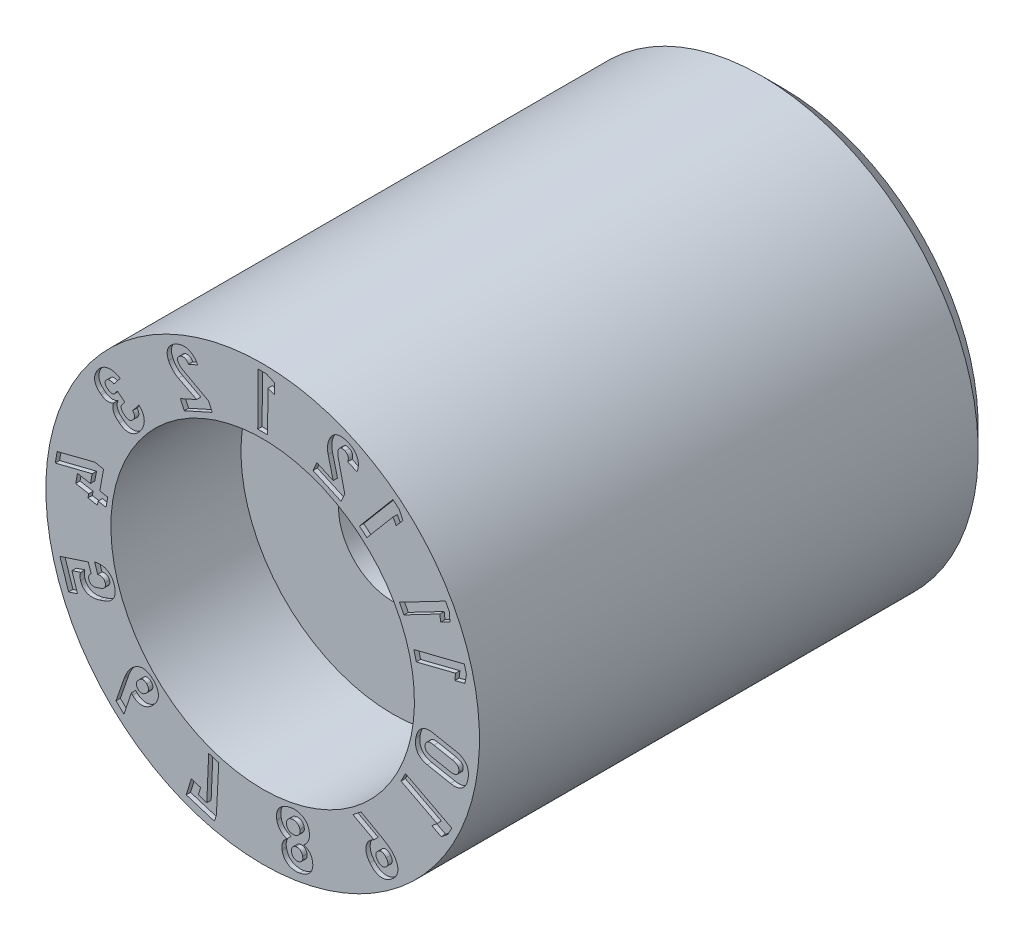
from build123d import *

# Parameters (mm, degrees)
CUT_EXTRUDE1_DEPTH = 0.1


with BuildPart() as part:
    # Sketch1 → Revolve1 (revolve)
    with BuildSketch(Plane(origin=(0, 0, 0), x_dir=(0, 0, -1), z_dir=(1, 0, 0)), mode=Mode.PRIVATE) as revolve1_sk:
        Polygon((12, 1.25), (12, 4.5), (11.5, 5), (0, 5), (0, 3.5), (3, 3.5), (3, 1.25), align=None)
    revolve(revolve1_sk.sketch.rotate(Axis((0, 0, 0), (0, 0, -1)), 180), axis=Axis((0, 0, 0), (0, 0, -1)))

    # Sketch2 → Cut-Extrude1 (cut)
    # profile 1 of 15: a face of its own
    with BuildSketch(Plane.XY):
        Polygon((-0.1134802, 3.635209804), (0.113138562, 3.633054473), (0.122147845, 4.570193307), (0.26814769, 4.513103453), (0.270554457, 4.754200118), (0.091451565, 4.837004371), (-0.102047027, 4.838691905), align=None)
    # profile 2 of 15: a face of its own
    with BuildSketch(Plane.XY):
        with BuildLine():
            Line((-1.246425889, 3.629500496), (-1.841836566, 3.95313337))
            add(Edge.make_bspline(
                [(-1.841836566, 3.95313337), (-1.867024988, 3.966640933), (-1.896766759, 3.986751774), (-1.925260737, 4.017127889), (-1.940885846, 4.035975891), (-1.949849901, 4.051525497), (-1.954700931, 4.061965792)],
                knots=[0, 0, 0, 0, 0.539912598, 0.66450377, 0.78319409, 1, 1, 1, 1], degree=3))
            Line((-1.954700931, 4.061965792), (-1.955388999, 4.063088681))
            add(Edge.make_bspline(
                [(-1.955388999, 4.063088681), (-1.961131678, 4.076487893), (-1.967575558, 4.09753426), (-1.964885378, 4.125686), (-1.95823551, 4.144970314), (-1.946880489, 4.162857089), (-1.924883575, 4.185700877), (-1.902981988, 4.197796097), (-1.887482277, 4.204933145)],
                knots=[0, 0, 0, 0, 0.247436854, 0.358127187, 0.470367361, 0.587238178, 0.71148399, 1, 1, 1, 1], degree=3))
            add(Edge.make_bspline(
                [(-1.887482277, 4.204933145), (-1.87182515, 4.212301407), (-1.84675559, 4.218740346), (-1.812976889, 4.216513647), (-1.7892417, 4.208902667), (-1.76629923, 4.196977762), (-1.737109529, 4.172367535), (-1.719317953, 4.148551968), (-1.709083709, 4.130825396)],
                knots=[0, 0, 0, 0, 0.241879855, 0.354192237, 0.469267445, 0.588145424, 0.713727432, 1, 1, 1, 1], degree=3))
            Line((-1.709083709, 4.130825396), (-1.49787548, 4.224722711))
            add(Edge.make_bspline(
                [(-1.49787548, 4.224722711), (-1.515029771, 4.25636283), (-1.542527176, 4.300472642), (-1.589034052, 4.349196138), (-1.625277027, 4.379582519), (-1.664082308, 4.403912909), (-1.704758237, 4.422405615), (-1.747310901, 4.434557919), (-1.791372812, 4.440744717), (-1.836602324, 4.440778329), (-1.899191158, 4.432178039), (-1.94500455, 4.416735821), (-1.974787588, 4.403297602)],
                knots=[0, 0, 0, 0, 0.185833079, 0.271834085, 0.354543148, 0.434818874, 0.512789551, 0.58957393, 0.667544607, 0.746872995, 0.827489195, 1, 1, 1, 1], degree=3))
            add(Edge.make_bspline(
                [(-1.974787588, 4.403297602), (-2.006416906, 4.389146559), (-2.050899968, 4.364887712), (-2.102423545, 4.32456869), (-2.134166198, 4.292814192), (-2.160354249, 4.258934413), (-2.180194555, 4.222734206), (-2.194226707, 4.184711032), (-2.201624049, 4.144786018), (-2.203219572, 4.103525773), (-2.196444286, 4.045236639), (-2.181792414, 4.002449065), (-2.169449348, 3.974367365)],
                knots=[0, 0, 0, 0, 0.194478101, 0.28254806, 0.36616185, 0.445730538, 0.521908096, 0.596845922, 0.672103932, 0.748712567, 0.827648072, 1, 1, 1, 1], degree=3))
            add(Edge.make_bspline(
                [(-2.169449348, 3.974367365), (-2.157698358, 3.9489313), (-2.138102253, 3.912740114), (-2.104894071, 3.868872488), (-2.077408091, 3.837288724), (-2.047251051, 3.808188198), (-2.004416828, 3.773078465), (-1.969714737, 3.750457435), (-1.945181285, 3.737965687)],
                knots=[0, 0, 0, 0, 0.24635447, 0.371238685, 0.498231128, 0.625663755, 0.750716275, 1, 1, 1, 1], degree=3))
            Line((-1.945181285, 3.737965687), (-1.524545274, 3.519900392))
            Line((-1.524545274, 3.519900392), (-1.897329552, 3.352452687))
            Line((-1.897329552, 3.352452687), (-1.808313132, 3.154337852))
            Line((-1.808313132, 3.154337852), (-1.163120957, 3.444183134))
            Line((-1.163120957, 3.444183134), (-1.246425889, 3.629500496))
        make_face()
    # profile 3 of 15: a face of its own
    with BuildSketch(Plane.XY):
        with BuildLine():
            Line((-2.853920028, 2.74460677), (-2.997997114, 2.561596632))
            add(Edge.make_bspline(
                [(-2.997997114, 2.561596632), (-2.989819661, 2.553175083), (-2.978784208, 2.539781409), (-2.967660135, 2.520217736), (-2.961348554, 2.505698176), (-2.957563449, 2.490933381), (-2.955496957, 2.476224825), (-2.955169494, 2.461530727), (-2.95706704, 2.446844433), (-2.961026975, 2.432364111), (-2.969201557, 2.412985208), (-2.977838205, 2.399418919), (-2.984479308, 2.390778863)],
                knots=[0, 0, 0, 0, 0.186025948, 0.272841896, 0.355691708, 0.435874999, 0.513332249, 0.590477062, 0.667826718, 0.746932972, 0.827427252, 1, 1, 1, 1], degree=3))
            add(Edge.make_bspline(
                [(-2.984479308, 2.390778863), (-2.996541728, 2.37588816), (-3.016560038, 2.355565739), (-3.049373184, 2.339725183), (-3.074103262, 2.334075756), (-3.099560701, 2.334127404), (-3.135068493, 2.343324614), (-3.159674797, 2.35766957), (-3.174779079, 2.369975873)],
                knots=[0, 0, 0, 0, 0.266119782, 0.383958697, 0.498069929, 0.613267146, 0.731491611, 1, 1, 1, 1], degree=3))
            Line((-3.174779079, 2.369975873), (-3.196755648, 2.387125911))
            add(Edge.make_bspline(
                [(-3.196755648, 2.387125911), (-3.213031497, 2.399448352), (-3.234001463, 2.419907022), (-3.254359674, 2.451107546), (-3.262737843, 2.47397875), (-3.266226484, 2.496759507), (-3.262446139, 2.527689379), (-3.251101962, 2.548789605), (-3.240977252, 2.561089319)],
                knots=[0, 0, 0, 0, 0.300693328, 0.428097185, 0.545951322, 0.657228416, 0.764774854, 1, 1, 1, 1], degree=3))
            Line((-3.240977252, 2.561089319), (-3.178402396, 2.640793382))
            Line((-3.178402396, 2.640793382), (-3.349186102, 2.775291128))
            Line((-3.349186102, 2.775291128), (-3.411760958, 2.695587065))
            add(Edge.make_bspline(
                [(-3.411760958, 2.695587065), (-3.419734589, 2.6854322), (-3.434635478, 2.672179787), (-3.459286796, 2.664572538), (-3.478742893, 2.66305857), (-3.499268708, 2.666341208), (-3.529260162, 2.676838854), (-3.550316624, 2.690543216), (-3.563802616, 2.701495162)],
                knots=[0, 0, 0, 0, 0.227690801, 0.334652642, 0.446366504, 0.566263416, 0.695466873, 1, 1, 1, 1], degree=3))
            Line((-3.563802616, 2.701495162), (-3.580207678, 2.714319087))
            add(Edge.make_bspline(
                [(-3.580207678, 2.714319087), (-3.593025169, 2.724486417), (-3.610591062, 2.740896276), (-3.625531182, 2.767486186), (-3.631557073, 2.786996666), (-3.633330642, 2.806709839), (-3.628679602, 2.833652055), (-3.6182975, 2.852023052), (-3.609560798, 2.863084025)],
                knots=[0, 0, 0, 0, 0.286987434, 0.411384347, 0.528029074, 0.640813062, 0.753408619, 1, 1, 1, 1], degree=3))
            add(Edge.make_bspline(
                [(-3.609560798, 2.863084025), (-3.603426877, 2.870660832), (-3.593087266, 2.881370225), (-3.576213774, 2.891238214), (-3.562949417, 2.897329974), (-3.548731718, 2.901593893), (-3.533594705, 2.90366872), (-3.517643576, 2.90404514), (-3.500927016, 2.902619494), (-3.483640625, 2.899426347), (-3.459343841, 2.892018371), (-3.44163109, 2.883739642), (-3.429773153, 2.877537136)],
                knots=[0, 0, 0, 0, 0.14918583, 0.222996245, 0.296639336, 0.371187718, 0.448158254, 0.5286829, 0.613797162, 0.703291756, 0.795969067, 1, 1, 1, 1], degree=3))
            Line((-3.429773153, 2.877537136), (-3.286082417, 3.060160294))
            add(Edge.make_bspline(
                [(-3.286082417, 3.060160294), (-3.31508121, 3.07924092), (-3.360473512, 3.102755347), (-3.423961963, 3.123110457), (-3.470442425, 3.131205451), (-3.51620188, 3.133918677), (-3.56094595, 3.130517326), (-3.604172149, 3.120917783), (-3.645817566, 3.105698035), (-3.685277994, 3.085012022), (-3.735217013, 3.049884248), (-3.76757485, 3.016626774), (-3.786758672, 2.992085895)],
                knots=[0, 0, 0, 0, 0.185755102, 0.272003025, 0.355978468, 0.437668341, 0.516842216, 0.595400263, 0.673986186, 0.753554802, 0.833228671, 1, 1, 1, 1], degree=3))
            add(Edge.make_bspline(
                [(-3.786758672, 2.992085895), (-3.80207439, 2.97231026), (-3.823387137, 2.942416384), (-3.845525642, 2.900201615), (-3.858359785, 2.869660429), (-3.867743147, 2.839242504), (-3.873725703, 2.808995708), (-3.876434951, 2.778906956), (-3.875449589, 2.74908421), (-3.871513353, 2.719815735), (-3.863642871, 2.691353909), (-3.85290268, 2.663640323), (-3.838642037, 2.636648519), (-3.820850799, 2.610635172), (-3.791710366, 2.576369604), (-3.766508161, 2.55276047), (-3.747799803, 2.538404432)],
                knots=[0, 0, 0, 0, 0.144969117, 0.211725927, 0.275613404, 0.336511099, 0.395693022, 0.453821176, 0.511004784, 0.568118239, 0.62437708, 0.681552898, 0.739899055, 0.800707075, 0.863632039, 1, 1, 1, 1], degree=3))
            Line((-3.747799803, 2.538404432), (-3.719477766, 2.516155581))
            add(Edge.make_bspline(
                [(-3.719477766, 2.516155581), (-3.699071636, 2.499723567), (-3.665509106, 2.479698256), (-3.616803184, 2.464016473), (-3.579945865, 2.458386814), (-3.542660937, 2.459042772), (-3.492117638, 2.467297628), (-3.456199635, 2.4831067), (-3.433561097, 2.496204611)],
                knots=[0, 0, 0, 0, 0.256817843, 0.378651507, 0.499846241, 0.620687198, 0.742908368, 1, 1, 1, 1], degree=3))
            add(Edge.make_bspline(
                [(-3.433561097, 2.496204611), (-3.439492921, 2.483265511), (-3.447482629, 2.463468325), (-3.452986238, 2.436097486), (-3.45595512, 2.41593365), (-3.455924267, 2.39571943), (-3.454382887, 2.375472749), (-3.451077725, 2.355103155), (-3.445150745, 2.334959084), (-3.437740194, 2.314839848), (-3.428305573, 2.295117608), (-3.416884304, 2.275958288), (-3.403884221, 2.257044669), (-3.388612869, 2.238822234), (-3.365698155, 2.214200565), (-3.346457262, 2.197101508), (-3.332621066, 2.18649052)],
                knots=[0, 0, 0, 0, 0.120732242, 0.179156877, 0.235905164, 0.292824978, 0.349690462, 0.407624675, 0.466993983, 0.52702443, 0.588865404, 0.651622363, 0.715561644, 0.7827963, 0.852537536, 1, 1, 1, 1], degree=3))
            Line((-3.332621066, 2.18649052), (-3.304299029, 2.164241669))
            add(Edge.make_bspline(
                [(-3.304299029, 2.164241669), (-3.278729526, 2.144083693), (-3.238627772, 2.117841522), (-3.180957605, 2.095129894), (-3.139008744, 2.084864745), (-3.097106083, 2.081392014), (-3.055637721, 2.084245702), (-3.01472181, 2.093835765), (-2.974604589, 2.109977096), (-2.93559574, 2.132482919), (-2.883652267, 2.171989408), (-2.849116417, 2.208778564), (-2.827753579, 2.235853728)],
                knots=[0, 0, 0, 0, 0.178576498, 0.260028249, 0.338439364, 0.414233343, 0.489377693, 0.565161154, 0.643413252, 0.725361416, 0.811053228, 1, 1, 1, 1], degree=3))
            add(Edge.make_bspline(
                [(-2.827753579, 2.235853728), (-2.806701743, 2.26310863), (-2.778480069, 2.305623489), (-2.751929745, 2.366627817), (-2.738242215, 2.411830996), (-2.730267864, 2.457121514), (-2.729525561, 2.502093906), (-2.733859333, 2.546567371), (-2.745225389, 2.590053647), (-2.762693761, 2.632300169), (-2.795282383, 2.687287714), (-2.82893074, 2.723028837), (-2.853920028, 2.74460677)],
                knots=[0, 0, 0, 0, 0.181595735, 0.267031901, 0.349589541, 0.429881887, 0.508385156, 0.585787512, 0.664560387, 0.744189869, 0.825878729, 1, 1, 1, 1], degree=3))
        make_face()
    # profile 4 of 15: a face of its own
    with BuildSketch(Plane.XY):
        Polygon((-3.873884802, 1.096013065), (-4.737677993, 0.875332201), (-4.783602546, 0.622327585), (-3.931349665, 0.835309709), (-3.970616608, 0.619088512), (-4.270709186, 0.673523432), (-4.311211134, 0.449979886), (-4.011210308, 0.395561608), (-4.028068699, 0.302731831), (-3.812796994, 0.263520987), (-3.795921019, 0.356509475), (-3.613069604, 0.323341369), (-3.572567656, 0.546884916), (-3.755353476, 0.580041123), (-3.668468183, 1.058788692), align=None)
    # profile 5 of 15: a face of its own
    with BuildSketch(Plane.XY):
        with BuildLine():
            Line((-3.874503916, -0.897675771), (-3.805070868, -1.112473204))
            add(Edge.make_bspline(
                [(-3.805070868, -1.112473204), (-3.784801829, -1.107611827), (-3.755752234, -1.104845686), (-3.718573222, -1.109416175), (-3.694503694, -1.117655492), (-3.673215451, -1.129902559), (-3.649245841, -1.152735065), (-3.637482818, -1.175141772), (-3.632319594, -1.191100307)],
                knots=[0, 0, 0, 0, 0.286271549, 0.412475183, 0.531825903, 0.646991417, 0.760338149, 1, 1, 1, 1], degree=3))
            add(Edge.make_bspline(
                [(-3.632319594, -1.191100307), (-3.626730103, -1.208025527), (-3.622277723, -1.234385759), (-3.62900585, -1.268260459), (-3.63983416, -1.290823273), (-3.655718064, -1.311507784), (-3.686135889, -1.336088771), (-3.71404315, -1.348751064), (-3.734136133, -1.355264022)],
                knots=[0, 0, 0, 0, 0.245289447, 0.356071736, 0.468102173, 0.585274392, 0.710393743, 1, 1, 1, 1], degree=3))
            Line((-3.734136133, -1.355264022), (-3.829707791, -1.386578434))
            add(Edge.make_bspline(
                [(-3.829707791, -1.386578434), (-3.849754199, -1.392360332), (-3.879270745, -1.400730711), (-3.917681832, -1.398847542), (-3.942248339, -1.393613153), (-3.963551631, -1.383280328), (-3.988165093, -1.363450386), (-3.999649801, -1.34191896), (-4.004525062, -1.326706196)],
                knots=[0, 0, 0, 0, 0.302991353, 0.431512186, 0.549947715, 0.661867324, 0.768838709, 1, 1, 1, 1], degree=3))
            add(Edge.make_bspline(
                [(-4.004525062, -1.326706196), (-4.009274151, -1.312294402), (-4.013547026, -1.290148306), (-4.01204225, -1.260753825), (-4.007187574, -1.240227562), (-3.999224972, -1.220935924), (-3.983636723, -1.197020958), (-3.967694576, -1.182154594), (-3.955590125, -1.173888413)],
                knots=[0, 0, 0, 0, 0.263177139, 0.386092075, 0.507659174, 0.627113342, 0.746106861, 1, 1, 1, 1], degree=3))
            Line((-3.955590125, -1.173888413), (-4.021279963, -0.973712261))
            Line((-4.021279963, -0.973712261), (-4.675226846, -1.187811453))
            Line((-4.675226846, -1.187811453), (-4.475001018, -1.798591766))
            Line((-4.475001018, -1.798591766), (-4.268641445, -1.731044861))
            Line((-4.268641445, -1.731044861), (-4.398538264, -1.334599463))
            Line((-4.398538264, -1.334599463), (-4.19730462, -1.268630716))
            add(Edge.make_bspline(
                [(-4.19730462, -1.268630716), (-4.202968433, -1.279879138), (-4.208373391, -1.29857202), (-4.212471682, -1.325095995), (-4.213084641, -1.347090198), (-4.212469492, -1.369678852), (-4.20890321, -1.399313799), (-4.204177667, -1.420978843), (-4.199272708, -1.434849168)],
                knots=[0, 0, 0, 0, 0.221290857, 0.341875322, 0.473265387, 0.609338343, 0.74075997, 1, 1, 1, 1], degree=3))
            add(Edge.make_bspline(
                [(-4.199272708, -1.434849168), (-4.190094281, -1.462306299), (-4.172683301, -1.501589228), (-4.138755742, -1.546053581), (-4.109622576, -1.573330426), (-4.077158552, -1.596101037), (-4.040629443, -1.612686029), (-4.001018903, -1.624663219), (-3.957891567, -1.630242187), (-3.911912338, -1.631378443), (-3.844603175, -1.624612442), (-3.793664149, -1.612231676), (-3.759540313, -1.600729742)],
                knots=[0, 0, 0, 0, 0.163393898, 0.23933488, 0.313590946, 0.387435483, 0.461667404, 0.538627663, 0.619718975, 0.705844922, 0.797241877, 1, 1, 1, 1], degree=3))
            Line((-3.759540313, -1.600729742), (-3.663968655, -1.56941533))
            add(Edge.make_bspline(
                [(-3.663968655, -1.56941533), (-3.62971555, -1.558185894), (-3.58106074, -1.537524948), (-3.523744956, -1.500241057), (-3.488106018, -1.469149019), (-3.458002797, -1.435193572), (-3.434305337, -1.397713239), (-3.416720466, -1.357357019), (-3.405436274, -1.314063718), (-3.400583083, -1.268399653), (-3.402407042, -1.202352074), (-3.414727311, -1.152732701), (-3.425188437, -1.119617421)],
                knots=[0, 0, 0, 0, 0.186919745, 0.272247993, 0.353373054, 0.431356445, 0.506632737, 0.582239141, 0.658645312, 0.737601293, 0.819506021, 1, 1, 1, 1], degree=3))
            add(Edge.make_bspline(
                [(-3.425188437, -1.119617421), (-3.434399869, -1.09020649), (-3.453975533, -1.048780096), (-3.488500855, -0.999371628), (-3.51871319, -0.967414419), (-3.552630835, -0.939909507), (-3.590237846, -0.917439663), (-3.631235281, -0.89995026), (-3.675491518, -0.888056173), (-3.722408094, -0.881608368), (-3.789586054, -0.880899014), (-3.840583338, -0.888925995), (-3.874503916, -0.897675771)],
                knots=[0, 0, 0, 0, 0.165309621, 0.244619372, 0.323096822, 0.400896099, 0.478636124, 0.557815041, 0.639725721, 0.724228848, 0.811710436, 1, 1, 1, 1], degree=3))
        make_face()
    # profile 6 of 15: a face of its own
    with BuildSketch(Plane.XY):
        with BuildLine():
            Line((-3.195774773, -2.887855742), (-3.381343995, -3.424873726))
            Line((-3.381343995, -3.424873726), (-3.199200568, -3.602670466))
            Line((-3.199200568, -3.602670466), (-3.026755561, -3.088592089))
            add(Edge.make_bspline(
                [(-3.026755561, -3.088592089), (-3.018507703, -3.100694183), (-3.008713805, -3.111760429), (-2.998337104, -3.122033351)],
                knots=[0.757709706, 0.757709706, 0.757709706, 0.757709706, 1, 1, 1, 1], degree=3))
            add(Edge.make_bspline(
                [(-2.998337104, -3.122033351), (-2.976510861, -3.143552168), (-2.941097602, -3.171681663), (-2.888590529, -3.197779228), (-2.84921371, -3.210405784), (-2.809097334, -3.21664989), (-2.768422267, -3.216738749), (-2.727516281, -3.210082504), (-2.686501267, -3.197246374), (-2.645526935, -3.178383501), (-2.589853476, -3.143094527), (-2.551060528, -3.109901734), (-2.526901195, -3.084530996)],
                knots=[0, 0, 0, 0, 0.171440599, 0.250313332, 0.326601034, 0.401649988, 0.47637042, 0.55300431, 0.632355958, 0.715925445, 0.804372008, 1, 1, 1, 1], degree=3))
            add(Edge.make_bspline(
                [(-2.526901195, -3.084530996), (-2.501862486, -3.058146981), (-2.467698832, -3.018282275), (-2.434925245, -2.958883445), (-2.417353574, -2.915377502), (-2.406344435, -2.871480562), (-2.402440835, -2.827631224), (-2.405487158, -2.783956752), (-2.415525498, -2.740855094), (-2.432256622, -2.698425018), (-2.464194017, -2.641368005), (-2.497137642, -2.60296306), (-2.521663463, -2.578879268)],
                knots=[0, 0, 0, 0, 0.186963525, 0.271936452, 0.353495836, 0.431521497, 0.507541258, 0.582570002, 0.659340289, 0.737870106, 0.820147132, 1, 1, 1, 1], degree=3))
            add(Edge.make_bspline(
                [(-2.521663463, -2.578879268), (-2.545992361, -2.5546786), (-2.585390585, -2.52331699), (-2.642682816, -2.49217508), (-2.685339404, -2.476435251), (-2.728452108, -2.467477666), (-2.771850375, -2.465218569), (-2.815232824, -2.469822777), (-2.858543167, -2.481056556), (-2.901184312, -2.499382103), (-2.959369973, -2.533048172), (-2.998265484, -2.567740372), (-3.023234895, -2.592874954)],
                knots=[0, 0, 0, 0, 0.18040979, 0.263072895, 0.342081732, 0.418699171, 0.493848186, 0.56974829, 0.647310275, 0.728304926, 0.813162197, 1, 1, 1, 1], degree=3))
            add(Edge.make_bspline(
                [(-3.023234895, -2.592874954), (-3.039113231, -2.60924353), (-3.061386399, -2.634984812), (-3.088592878, -2.672281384), (-3.129626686, -2.734784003), (-3.157360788, -2.791744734), (-3.177077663, -2.838566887)],
                knots=[0, 0, 0, 0, 0.229583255, 0.350319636, 0.475661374, 1, 1, 1, 1], degree=3))
            add(Edge.make_bspline(
                [(-3.177077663, -2.838566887), (-3.180307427, -2.846775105), (-3.187860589, -2.862713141), (-3.192592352, -2.879702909), (-3.195774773, -2.887855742)],
                knots=[0, 0, 0, 0, 0.502193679, 1, 1, 1, 1], degree=3))
        make_face()
        with BuildLine():
            add(Edge.make_bspline(
                [(-2.673148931, -2.734023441), (-2.660515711, -2.746646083), (-2.643897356, -2.767321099), (-2.632751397, -2.799500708), (-2.630728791, -2.823388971), (-2.63414867, -2.847534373), (-2.646713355, -2.881135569), (-2.664606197, -2.902937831), (-2.677676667, -2.916820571)],
                knots=[0, 0, 0, 0, 0.259214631, 0.373657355, 0.486603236, 0.601859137, 0.722848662, 1, 1, 1, 1], degree=3))
            add(Edge.make_bspline(
                [(-2.677676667, -2.916820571), (-2.693400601, -2.933170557), (-2.717767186, -2.953636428), (-2.754347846, -2.970860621), (-2.780308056, -2.97672978), (-2.805779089, -2.977003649), (-2.839612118, -2.968283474), (-2.86163096, -2.952605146), (-2.874417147, -2.939902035)],
                knots=[0, 0, 0, 0, 0.294939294, 0.420169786, 0.537632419, 0.648469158, 0.757895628, 1, 1, 1, 1], degree=3))
            add(Edge.make_bspline(
                [(-2.874417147, -2.939902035), (-2.887550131, -2.927669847), (-2.902952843, -2.905731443), (-2.912563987, -2.872108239), (-2.91258254, -2.846296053), (-2.906899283, -2.820071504), (-2.890617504, -2.783178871), (-2.870387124, -2.758771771), (-2.855450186, -2.742972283)],
                knots=[0, 0, 0, 0, 0.2398179, 0.35038577, 0.463369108, 0.581792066, 0.707462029, 1, 1, 1, 1], degree=3))
            add(Edge.make_bspline(
                [(-2.855450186, -2.742972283), (-2.841629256, -2.728556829), (-2.819836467, -2.711141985), (-2.786893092, -2.697690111), (-2.763025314, -2.693787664), (-2.739155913, -2.695289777), (-2.707128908, -2.7062482), (-2.685550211, -2.721108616), (-2.673148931, -2.734023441)],
                knots=[0, 0, 0, 0, 0.277582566, 0.397866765, 0.512799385, 0.62583409, 0.741295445, 1, 1, 1, 1], degree=3))
        make_face(mode=Mode.SUBTRACT)
    # profile 7 of 15: a face of its own
    with BuildSketch(Plane.XY):
        Polygon((-1.067288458, -4.553962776), (-1.012207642, -3.476805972), (-1.245038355, -3.4044337), (-1.288030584, -4.414768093), (-1.484221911, -4.353649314), (-1.430534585, -4.181924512), (-1.645364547, -4.114997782), (-1.763480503, -4.493690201), (-1.111766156, -4.696606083), align=None)
    # profile 8 of 15: a face of its own
    with BuildSketch(Plane.XY):
        with BuildLine():
            Line((0.325150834, -3.939334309), (0.328730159, -3.958761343))
            add(Edge.make_bspline(
                [(0.328730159, -3.958761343), (0.333502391, -3.987983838), (0.348304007, -4.030166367), (0.378157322, -4.081878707), (0.406604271, -4.117311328), (0.439396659, -4.148865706), (0.487974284, -4.184437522), (0.52936808, -4.202772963), (0.558161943, -4.210750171)],
                knots=[0, 0, 0, 0, 0.246741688, 0.370594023, 0.497967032, 0.625509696, 0.750304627, 1, 1, 1, 1], degree=3))
            add(Edge.make_bspline(
                [(0.558161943, -4.210750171), (0.537485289, -4.225716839), (0.509541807, -4.252146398), (0.480053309, -4.293809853), (0.46299868, -4.32774057), (0.45005605, -4.362899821), (0.44060531, -4.41058026), (0.441364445, -4.446881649), (0.44573792, -4.470322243)],
                knots=[0, 0, 0, 0, 0.256852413, 0.384064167, 0.512331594, 0.638329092, 0.760349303, 1, 1, 1, 1], degree=3))
            Line((0.44573792, -4.470322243), (0.451292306, -4.501271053))
            add(Edge.make_bspline(
                [(0.451292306, -4.501271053), (0.456418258, -4.530543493), (0.469496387, -4.572744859), (0.497526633, -4.623383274), (0.523205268, -4.656609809), (0.553323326, -4.685476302), (0.587361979, -4.70976077), (0.625158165, -4.729153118), (0.666462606, -4.743679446), (0.71073161, -4.75308994), (0.774740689, -4.75827516), (0.823802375, -4.753805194), (0.856713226, -4.747866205)],
                knots=[0, 0, 0, 0, 0.166941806, 0.245901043, 0.324166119, 0.402022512, 0.47953714, 0.558336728, 0.639971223, 0.724914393, 0.811973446, 1, 1, 1, 1], degree=3))
            add(Edge.make_bspline(
                [(0.856713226, -4.747866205), (0.889660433, -4.74204473), (0.937194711, -4.728878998), (0.995400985, -4.701785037), (1.033648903, -4.677567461), (1.067323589, -4.649708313), (1.095967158, -4.61828683), (1.119283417, -4.583651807), (1.137496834, -4.546099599), (1.149667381, -4.505938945), (1.159098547, -4.44880368), (1.15540119, -4.404633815), (1.150499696, -4.375475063)],
                knots=[0, 0, 0, 0, 0.188044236, 0.275560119, 0.360013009, 0.441803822, 0.520508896, 0.59814778, 0.675716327, 0.754188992, 0.833242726, 1, 1, 1, 1], degree=3))
            Line((1.150499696, -4.375475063), (1.14494531, -4.344526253))
            add(Edge.make_bspline(
                [(1.14494531, -4.344526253), (1.141068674, -4.320535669), (1.128637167, -4.285946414), (1.102714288, -4.244190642), (1.077819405, -4.216030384), (1.049602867, -4.19045602), (1.007165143, -4.16190057), (0.97133026, -4.147519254), (0.946672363, -4.140803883)],
                knots=[0, 0, 0, 0, 0.24228418, 0.363838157, 0.489932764, 0.617220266, 0.744143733, 1, 1, 1, 1], degree=3))
            add(Edge.make_bspline(
                [(0.946672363, -4.140803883), (0.971076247, -4.122818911), (1.003769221, -4.090938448), (1.03784115, -4.040641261), (1.05761726, -3.999537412), (1.07233672, -3.956509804), (1.083352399, -3.897871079), (1.081548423, -3.85316837), (1.076337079, -3.824232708)],
                knots=[0, 0, 0, 0, 0.252403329, 0.376970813, 0.504622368, 0.631472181, 0.755006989, 1, 1, 1, 1], degree=3))
            Line((1.076337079, -3.824232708), (1.072757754, -3.804805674))
            add(Edge.make_bspline(
                [(1.072757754, -3.804805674), (1.067380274, -3.773731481), (1.053719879, -3.728893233), (1.023872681, -3.675232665), (0.996473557, -3.640209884), (0.964472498, -3.609634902), (0.928181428, -3.584121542), (0.887933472, -3.563488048), (0.843684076, -3.548748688), (0.796396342, -3.538708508), (0.727825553, -3.533083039), (0.675222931, -3.53830787), (0.639916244, -3.544469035)],
                knots=[0, 0, 0, 0, 0.16638843, 0.24484758, 0.322812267, 0.400145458, 0.477565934, 0.556117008, 0.637943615, 0.722946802, 0.810666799, 1, 1, 1, 1], degree=3))
            add(Edge.make_bspline(
                [(0.639916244, -3.544469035), (0.604734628, -3.550840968), (0.553742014, -3.564668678), (0.491492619, -3.593813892), (0.45044313, -3.619579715), (0.414455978, -3.649132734), (0.383505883, -3.682127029), (0.358635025, -3.718830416), (0.339390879, -3.758603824), (0.325968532, -3.800924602), (0.316871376, -3.861574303), (0.319496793, -3.908336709), (0.325150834, -3.939334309)],
                knots=[0, 0, 0, 0, 0.188910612, 0.277155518, 0.362104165, 0.4441637, 0.522419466, 0.600160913, 0.677336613, 0.755001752, 0.833682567, 1, 1, 1, 1], degree=3))
        make_face()
        with BuildLine():
            Line((0.856699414, -3.877278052), (0.858674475, -3.888799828))
            add(Edge.make_bspline(
                [(0.858674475, -3.888799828), (0.860864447, -3.901317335), (0.862258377, -3.920367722), (0.85789469, -3.944893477), (0.85267454, -3.962181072), (0.844725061, -3.978241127), (0.834427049, -3.992949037), (0.82208718, -4.006534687), (0.807448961, -4.018515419), (0.791019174, -4.029248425), (0.76561709, -4.040623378), (0.745124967, -4.046580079), (0.730801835, -4.048984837)],
                knots=[0, 0, 0, 0, 0.165972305, 0.245197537, 0.323319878, 0.400411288, 0.477436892, 0.55648413, 0.638614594, 0.723145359, 0.811259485, 1, 1, 1, 1], degree=3))
            add(Edge.make_bspline(
                [(0.730801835, -4.048984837), (0.716561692, -4.051587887), (0.695273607, -4.053661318), (0.667648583, -4.051169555), (0.648586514, -4.047292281), (0.630789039, -4.041039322), (0.614528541, -4.032465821), (0.599635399, -4.022029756), (0.586307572, -4.009652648), (0.575128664, -3.995213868), (0.562967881, -3.973365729), (0.557007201, -3.955296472), (0.555125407, -3.942593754)],
                knots=[0, 0, 0, 0, 0.188291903, 0.275651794, 0.359527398, 0.440400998, 0.519826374, 0.597589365, 0.676055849, 0.75519832, 0.833743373, 1, 1, 1, 1], degree=3))
            Line((0.555125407, -3.942593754), (0.552834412, -3.930409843))
            add(Edge.make_bspline(
                [(0.552834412, -3.930409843), (0.550496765, -3.916775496), (0.549021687, -3.896265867), (0.552589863, -3.869617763), (0.557942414, -3.851012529), (0.565514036, -3.833482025), (0.575641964, -3.817477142), (0.588054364, -3.803071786), (0.602520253, -3.790239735), (0.618967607, -3.779079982), (0.644014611, -3.766954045), (0.664465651, -3.761053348), (0.67862668, -3.758482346)],
                knots=[0, 0, 0, 0, 0.17338604, 0.255215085, 0.33550126, 0.415116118, 0.493570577, 0.571725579, 0.652497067, 0.735080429, 0.819818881, 1, 1, 1, 1], degree=3))
            add(Edge.make_bspline(
                [(0.67862668, -3.758482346), (0.692782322, -3.755595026), (0.714038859, -3.754367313), (0.741701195, -3.757378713), (0.760901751, -3.762449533), (0.779041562, -3.769528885), (0.795821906, -3.778843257), (0.810715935, -3.790775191), (0.824096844, -3.804487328), (0.835638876, -3.820128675), (0.848408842, -3.843877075), (0.854245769, -3.863631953), (0.856699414, -3.877278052)],
                knots=[0, 0, 0, 0, 0.179905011, 0.26404949, 0.346402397, 0.427052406, 0.506674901, 0.584959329, 0.664451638, 0.745287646, 0.826806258, 1, 1, 1, 1], degree=3))
        make_face(mode=Mode.SUBTRACT)
        with BuildLine():
            Line((0.921116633, -4.375726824), (0.922986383, -4.387027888))
            add(Edge.make_bspline(
                [(0.922986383, -4.387027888), (0.925099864, -4.398782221), (0.926496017, -4.416428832), (0.923765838, -4.439395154), (0.919389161, -4.455270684), (0.913092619, -4.470092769), (0.904776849, -4.483562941), (0.894651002, -4.495889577), (0.882568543, -4.506752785), (0.868647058, -4.515992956), (0.847778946, -4.526888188), (0.830156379, -4.531282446), (0.818223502, -4.533747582)],
                knots=[0, 0, 0, 0, 0.17640619, 0.259203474, 0.340268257, 0.418727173, 0.496173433, 0.57316953, 0.653516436, 0.73504445, 0.819324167, 1, 1, 1, 1], degree=3))
            add(Edge.make_bspline(
                [(0.818223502, -4.533747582), (0.806222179, -4.53609602), (0.788180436, -4.537216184), (0.764733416, -4.534794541), (0.7484065, -4.530912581), (0.733203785, -4.524882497), (0.719513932, -4.516511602), (0.70677309, -4.506816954), (0.695690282, -4.494872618), (0.686330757, -4.481182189), (0.67528357, -4.460859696), (0.670851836, -4.443674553), (0.668383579, -4.432099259)],
                knots=[0, 0, 0, 0, 0.179633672, 0.264185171, 0.346047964, 0.425846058, 0.503691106, 0.581471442, 0.660754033, 0.742193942, 0.82503507, 1, 1, 1, 1], degree=3))
            Line((0.668383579, -4.432099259), (0.666313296, -4.419810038))
            add(Edge.make_bspline(
                [(0.666313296, -4.419810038), (0.663626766, -4.407495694), (0.662765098, -4.389057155), (0.664912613, -4.364947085), (0.669062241, -4.348111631), (0.675447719, -4.332379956), (0.683424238, -4.317730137), (0.693709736, -4.304774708), (0.705543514, -4.293022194), (0.719311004, -4.283034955), (0.74005437, -4.271452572), (0.757767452, -4.266910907), (0.769702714, -4.26453304)],
                knots=[0, 0, 0, 0, 0.179326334, 0.262457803, 0.345261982, 0.426074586, 0.504638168, 0.582803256, 0.661660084, 0.742329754, 0.825191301, 1, 1, 1, 1], degree=3))
            add(Edge.make_bspline(
                [(0.769702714, -4.26453304), (0.781746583, -4.262675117), (0.799876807, -4.260888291), (0.82338441, -4.264254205), (0.839778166, -4.268885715), (0.85496148, -4.275817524), (0.869102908, -4.284461), (0.881853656, -4.295270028), (0.893157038, -4.308145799), (0.902685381, -4.322831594), (0.914209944, -4.344685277), (0.918408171, -4.3632711), (0.921116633, -4.375726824)],
                knots=[0, 0, 0, 0, 0.173570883, 0.25536576, 0.335658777, 0.414438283, 0.491431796, 0.570109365, 0.650651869, 0.733575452, 0.818033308, 1, 1, 1, 1], degree=3))
        make_face(mode=Mode.SUBTRACT)
    # profile 9 of 15: a face of its own
    with BuildSketch(Plane.XY):
        with BuildLine():
            Line((3.021964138, -3.297964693), (3.021355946, -3.297124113))
            add(Edge.make_bspline(
                [(3.021355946, -3.297124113), (3.008361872, -3.28079584), (2.987078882, -3.256776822), (2.954617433, -3.227436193), (2.927596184, -3.205006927), (2.897991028, -3.18304463), (2.854899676, -3.152700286), (2.820461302, -3.13142898), (2.796843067, -3.11721271)],
                knots=[0, 0, 0, 0, 0.216500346, 0.331860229, 0.453504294, 0.580562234, 0.71402831, 1, 1, 1, 1], degree=3))
            add(Edge.make_bspline(
                [(2.796843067, -3.11721271), (2.789992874, -3.112662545), (2.776079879, -3.104178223), (2.761949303, -3.096058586), (2.7547585, -3.092381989)],
                knots=[0, 0, 0, 0, 0.504559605, 1, 1, 1, 1], degree=3))
            Line((2.7547585, -3.092381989), (2.269718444, -2.819660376))
            Line((2.269718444, -2.819660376), (2.081414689, -2.966790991))
            Line((2.081414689, -2.966790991), (2.564517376, -3.227712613))
            add(Edge.make_bspline(
                [(2.564517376, -3.227712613), (2.56340975, -3.228137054), (2.554802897, -3.231512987), (2.530189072, -3.242768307), (2.508866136, -3.25768766), (2.494705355, -3.268374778)],
                knots=[0.563703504, 0.563703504, 0.563703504, 0.563703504, 0.582833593, 0.712799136, 1, 1, 1, 1], degree=3))
            add(Edge.make_bspline(
                [(2.494705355, -3.268374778), (2.472097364, -3.286077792), (2.441517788, -3.316053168), (2.411348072, -3.36336758), (2.394982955, -3.400696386), (2.384327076, -3.439855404), (2.378831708, -3.480320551), (2.380300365, -3.521975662), (2.386796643, -3.564531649), (2.399387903, -3.607343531), (2.424277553, -3.665584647), (2.45087068, -3.706341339), (2.471322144, -3.732233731)],
                knots=[0, 0, 0, 0, 0.165144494, 0.243174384, 0.321091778, 0.398352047, 0.475654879, 0.554734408, 0.636925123, 0.722391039, 0.810350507, 1, 1, 1, 1], degree=3))
            add(Edge.make_bspline(
                [(2.471322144, -3.732233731), (2.494057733, -3.761076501), (2.529698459, -3.800277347), (2.584401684, -3.841352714), (2.625441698, -3.864846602), (2.667674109, -3.881460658), (2.710728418, -3.891131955), (2.754446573, -3.894159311), (2.798704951, -3.890249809), (2.843159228, -3.879170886), (2.904339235, -3.854949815), (2.946828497, -3.826837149), (2.974203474, -3.805714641)],
                knots=[0, 0, 0, 0, 0.187500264, 0.273117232, 0.354450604, 0.432443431, 0.507964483, 0.582802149, 0.659215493, 0.737785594, 0.819997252, 1, 1, 1, 1], degree=3))
            add(Edge.make_bspline(
                [(2.974203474, -3.805714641), (3.001322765, -3.784651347), (3.037985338, -3.749937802), (3.075984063, -3.696648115), (3.097082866, -3.655936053), (3.111419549, -3.61362772), (3.118845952, -3.570127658), (3.119710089, -3.525665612), (3.113641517, -3.480317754), (3.100710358, -3.434465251), (3.073420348, -3.371222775), (3.044732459, -3.326360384), (3.021964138, -3.297964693)],
                knots=[0, 0, 0, 0, 0.17795754, 0.259338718, 0.337978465, 0.414606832, 0.489763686, 0.565653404, 0.644066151, 0.725865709, 0.811613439, 1, 1, 1, 1], degree=3))
        make_face()
        with BuildLine():
            Line((2.84982019, -3.444715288), (2.850428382, -3.445555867))
            add(Edge.make_bspline(
                [(2.850428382, -3.445555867), (2.863036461, -3.461301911), (2.878091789, -3.486473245), (2.888675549, -3.522410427), (2.889942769, -3.547639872), (2.885669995, -3.571733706), (2.871668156, -3.602938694), (2.853274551, -3.62207931), (2.839188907, -3.632976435)],
                knots=[0, 0, 0, 0, 0.283688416, 0.407363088, 0.523428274, 0.635843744, 0.74850465, 1, 1, 1, 1], degree=3))
            add(Edge.make_bspline(
                [(2.839188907, -3.632976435), (2.825075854, -3.644304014), (2.80160714, -3.657482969), (2.767517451, -3.663846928), (2.742816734, -3.662028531), (2.718561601, -3.6546291), (2.686139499, -3.635440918), (2.665298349, -3.614603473), (2.653033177, -3.598410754)],
                knots=[0, 0, 0, 0, 0.252508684, 0.36676778, 0.478577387, 0.594423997, 0.71702642, 1, 1, 1, 1], degree=3))
            add(Edge.make_bspline(
                [(2.653033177, -3.598410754), (2.63984012, -3.581388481), (2.623670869, -3.555726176), (2.61254063, -3.518737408), (2.610873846, -3.492986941), (2.614617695, -3.468183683), (2.628777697, -3.436280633), (2.647401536, -3.416717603), (2.661666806, -3.405618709)],
                knots=[0, 0, 0, 0, 0.286765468, 0.410369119, 0.526244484, 0.638108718, 0.751246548, 1, 1, 1, 1], degree=3))
            add(Edge.make_bspline(
                [(2.661666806, -3.405618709), (2.675729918, -3.394742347), (2.698943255, -3.381276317), (2.733128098, -3.376217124), (2.758029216, -3.378527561), (2.782588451, -3.386592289), (2.816036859, -3.40608476), (2.836813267, -3.428395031), (2.84982019, -3.444715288)],
                knots=[0, 0, 0, 0, 0.246461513, 0.358247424, 0.470729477, 0.587689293, 0.711270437, 1, 1, 1, 1], degree=3))
        make_face(mode=Mode.SUBTRACT)
    # profile 10 of 15: a face of its own
    with BuildSketch(Plane.XY):
        Polygon((3.294329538, -1.541973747), (3.189967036, -1.742924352), (4.020342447, -2.17443261), (3.903727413, -2.278545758), (4.11730458, -2.389534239), (4.271701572, -2.267631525), (4.360895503, -2.096109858), align=None)
    # profile 11 of 15: a face of its own
    with BuildSketch(Plane.XY):
        with BuildLine():
            Line((3.798706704, -1.114159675), (4.332077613, -1.218730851))
            add(Edge.make_bspline(
                [(4.332077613, -1.218730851), (4.357060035, -1.223352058), (4.394188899, -1.228726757), (4.442779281, -1.227742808), (4.476724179, -1.224593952), (4.508908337, -1.217443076), (4.539621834, -1.207545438), (4.568576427, -1.193979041), (4.595721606, -1.17723428), (4.621223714, -1.15765997), (4.644220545, -1.134615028), (4.664840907, -1.108483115), (4.683319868, -1.079374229), (4.699654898, -1.047232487), (4.718638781, -0.998736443), (4.728931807, -0.959942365), (4.734040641, -0.932985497)],
                knots=[0, 0, 0, 0, 0.135937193, 0.19912061, 0.259192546, 0.317666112, 0.374795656, 0.431190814, 0.487946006, 0.544824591, 0.602462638, 0.661310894, 0.72224251, 0.786291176, 0.85352942, 1, 1, 1, 1], degree=3))
            add(Edge.make_bspline(
                [(4.734040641, -0.932985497), (4.739226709, -0.906017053), (4.744948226, -0.86607642), (4.745238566, -0.81391412), (4.742646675, -0.777850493), (4.736404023, -0.743938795), (4.727415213, -0.711854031), (4.714745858, -0.681953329), (4.698882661, -0.654182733), (4.680126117, -0.628465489), (4.658142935, -0.605399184), (4.63371533, -0.584277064), (4.60628002, -0.565913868), (4.576043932, -0.549944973), (4.531040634, -0.531124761), (4.494646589, -0.521734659), (4.469640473, -0.516634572)],
                knots=[0, 0, 0, 0, 0.146645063, 0.214326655, 0.277956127, 0.339220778, 0.397956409, 0.455358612, 0.511964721, 0.568234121, 0.624704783, 0.68157417, 0.740176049, 0.800385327, 0.863730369, 1, 1, 1, 1], degree=3))
            Line((4.469640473, -0.516634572), (3.936269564, -0.412063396))
            add(Edge.make_bspline(
                [(3.936269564, -0.412063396), (3.911283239, -0.407299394), (3.874190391, -0.402334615), (3.825501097, -0.402692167), (3.791503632, -0.406187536), (3.759254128, -0.413198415), (3.72867048, -0.423312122), (3.699860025, -0.436834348), (3.672529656, -0.453310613), (3.647219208, -0.473146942), (3.624090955, -0.496149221), (3.603589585, -0.522389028), (3.584640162, -0.551221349), (3.568865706, -0.583667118), (3.549173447, -0.631847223), (3.539347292, -0.670851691), (3.534072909, -0.697736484)],
                knots=[0, 0, 0, 0, 0.135910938, 0.198948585, 0.259580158, 0.318042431, 0.374806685, 0.431190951, 0.487608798, 0.544833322, 0.602460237, 0.661297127, 0.722333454, 0.786297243, 0.85355771, 1, 1, 1, 1], degree=3))
            add(Edge.make_bspline(
                [(3.534072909, -0.697736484), (3.528474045, -0.724701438), (3.523794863, -0.7646833), (3.522701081, -0.816866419), (3.525774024, -0.852945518), (3.532034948, -0.886954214), (3.541832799, -0.91892222), (3.554583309, -0.948912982), (3.570709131, -0.976752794), (3.589687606, -1.002447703), (3.611697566, -1.025684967), (3.636256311, -1.046650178), (3.663526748, -1.065090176), (3.693539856, -1.080990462), (3.738115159, -1.099538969), (3.773928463, -1.109423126), (3.798706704, -1.114159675)],
                knots=[0, 0, 0, 0, 0.146914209, 0.21455308, 0.278421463, 0.339962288, 0.39888971, 0.456642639, 0.513635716, 0.570323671, 0.626862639, 0.684200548, 0.74245671, 0.802311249, 0.865299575, 1, 1, 1, 1], degree=3))
        make_face()
        with BuildLine():
            Line((3.949445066, -0.644217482), (4.369865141, -0.72664967))
            add(Edge.make_bspline(
                [(4.369865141, -0.72664967), (4.395174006, -0.731486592), (4.430783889, -0.741477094), (4.471866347, -0.763557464), (4.495114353, -0.782480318), (4.512439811, -0.804895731), (4.525801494, -0.841467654), (4.52538865, -0.871579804), (4.520882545, -0.891369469)],
                knots=[0, 0, 0, 0, 0.304099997, 0.43164383, 0.547064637, 0.655050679, 0.761122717, 1, 1, 1, 1], degree=3))
            add(Edge.make_bspline(
                [(4.520882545, -0.891369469), (4.518778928, -0.90185069), (4.51451814, -0.916874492), (4.506141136, -0.935298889), (4.498553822, -0.947245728), (4.489686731, -0.957694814), (4.479776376, -0.966981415), (4.468672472, -0.97487908), (4.451555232, -0.98311183), (4.427262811, -0.990480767), (4.380958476, -0.996106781), (4.344154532, -0.991334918), (4.318902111, -0.986576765)],
                knots=[0, 0, 0, 0, 0.126095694, 0.183340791, 0.238152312, 0.292438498, 0.344552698, 0.398015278, 0.452420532, 0.567895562, 0.695686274, 1, 1, 1, 1], degree=3))
            Line((4.318902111, -0.986576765), (3.898482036, -0.904144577))
            add(Edge.make_bspline(
                [(3.898482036, -0.904144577), (3.873189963, -0.899107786), (3.837311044, -0.889579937), (3.796537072, -0.866896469), (3.773365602, -0.848092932), (3.755890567, -0.825824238), (3.742104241, -0.789446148), (3.743351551, -0.759268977), (3.747158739, -0.73958614)],
                knots=[0, 0, 0, 0, 0.305331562, 0.43224865, 0.547772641, 0.655293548, 0.76205519, 1, 1, 1, 1], degree=3))
            add(Edge.make_bspline(
                [(3.747158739, -0.73958614), (3.749361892, -0.729147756), (3.753380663, -0.713917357), (3.762204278, -0.695589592), (3.769825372, -0.68362085), (3.778454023, -0.672864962), (3.788505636, -0.663668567), (3.799823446, -0.655933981), (3.816682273, -0.647379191), (3.840957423, -0.639931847), (3.887290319, -0.634835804), (3.924099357, -0.639374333), (3.949445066, -0.644217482)],
                knots=[0, 0, 0, 0, 0.125882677, 0.184117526, 0.238836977, 0.29266524, 0.346003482, 0.398620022, 0.453599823, 0.568090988, 0.695272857, 1, 1, 1, 1], degree=3))
        make_face(mode=Mode.SUBTRACT)
    # profile 12 of 15: a face of its own
    with BuildSketch(Plane.XY):
        Polygon((3.487705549, 1.0328711), (3.542933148, 0.813418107), (4.449007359, 1.041192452), (4.431211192, 0.8861237), (4.664047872, 0.944584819), (4.698991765, 1.138131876), (4.65175467, 1.32538108), align=None)
    # profile 13 of 15: a face of its own
    with BuildSketch(Plane.XY):
        Polygon((3.154124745, 1.810905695), (3.258681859, 1.610344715), (4.086152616, 2.041975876), (4.104798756, 1.887269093), (4.317455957, 1.998120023), (4.306518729, 2.194110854), (4.217198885, 2.365282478), align=None)
    # profile 14 of 15: a face of its own
    with BuildSketch(Plane.XY):
        Polygon((2.231618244, 2.871986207), (2.404065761, 2.726427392), (3.004992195, 3.438534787), (3.080657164, 3.302594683), (3.235124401, 3.485454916), (3.150792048, 3.6623515), (3.003594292, 3.786698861), align=None)
    # profile 15 of 15: a face of its own
    with BuildSketch(Plane.XY):
        with BuildLine():
            Line((1.893827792, 3.338787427), (1.741068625, 4.002694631))
            add(Edge.make_bspline(
                [(1.741068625, 4.002694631), (1.73470958, 4.030798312), (1.730117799, 4.066645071), (1.733918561, 4.108392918), (1.738040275, 4.132636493), (1.7434013, 4.149799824), (1.748119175, 4.160421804)],
                knots=[0, 0, 0, 0, 0.540691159, 0.665423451, 0.782944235, 1, 1, 1, 1], degree=3))
            Line((1.748119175, 4.160421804), (1.74878, 4.161820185))
            add(Edge.make_bspline(
                [(1.74878, 4.161820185), (1.754508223, 4.175348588), (1.766743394, 4.193467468), (1.789381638, 4.210365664), (1.808296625, 4.218114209), (1.829306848, 4.221432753), (1.861139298, 4.220047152), (1.884842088, 4.211564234), (1.900553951, 4.204797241)],
                knots=[0, 0, 0, 0, 0.246319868, 0.357332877, 0.469334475, 0.58552012, 0.711407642, 1, 1, 1, 1], degree=3))
            add(Edge.make_bspline(
                [(1.900553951, 4.204797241), (1.916324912, 4.197678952), (1.937941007, 4.183255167), (1.958759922, 4.156446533), (1.969073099, 4.133612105), (1.975067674, 4.108319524), (1.976294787, 4.069939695), (1.969932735, 4.040621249), (1.963438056, 4.021120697)],
                knots=[0, 0, 0, 0, 0.241246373, 0.353767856, 0.468421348, 0.587419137, 0.713440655, 1, 1, 1, 1], degree=3))
            Line((1.963438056, 4.021120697), (2.174862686, 3.924801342))
            add(Edge.make_bspline(
                [(2.174862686, 3.924801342), (2.187422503, 3.958667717), (2.201696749, 4.008828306), (2.207899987, 4.07619946), (2.206509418, 4.123678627), (2.19877379, 4.168918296), (2.186080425, 4.212010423), (2.166717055, 4.252062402), (2.142012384, 4.289316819), (2.112083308, 4.323368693), (2.064081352, 4.364878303), (2.021865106, 4.388987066), (1.991986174, 4.402622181)],
                knots=[0, 0, 0, 0, 0.18597981, 0.271930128, 0.354611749, 0.434787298, 0.512453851, 0.589850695, 0.66756919, 0.746671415, 0.827281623, 1, 1, 1, 1], degree=3))
            add(Edge.make_bspline(
                [(1.991986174, 4.402622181), (1.960058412, 4.416697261), (1.912215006, 4.434653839), (1.847384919, 4.446574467), (1.802362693, 4.449299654), (1.759431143, 4.446522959), (1.718993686, 4.437415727), (1.681065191, 4.422614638), (1.645961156, 4.401931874), (1.61388829, 4.375417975), (1.574398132, 4.331434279), (1.55167763, 4.291858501), (1.538961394, 4.263710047)],
                knots=[0, 0, 0, 0, 0.194790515, 0.283003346, 0.366488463, 0.445617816, 0.521984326, 0.596590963, 0.671672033, 0.748092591, 0.82763828, 1, 1, 1, 1], degree=3))
            add(Edge.make_bspline(
                [(1.538961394, 4.263710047), (1.527197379, 4.238248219), (1.513908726, 4.199256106), (1.502374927, 4.145271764), (1.497135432, 4.10354889), (1.495368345, 4.061340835), (1.497170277, 4.005549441), (1.503920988, 3.964267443), (1.510399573, 3.93738395)],
                knots=[0, 0, 0, 0, 0.245645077, 0.370071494, 0.497231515, 0.62431929, 0.750624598, 1, 1, 1, 1], degree=3))
            Line((1.510399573, 3.93738395), (1.626160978, 3.475370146))
            Line((1.626160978, 3.475370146), (1.251740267, 3.644695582))
            Line((1.251740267, 3.644695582), (1.161890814, 3.445695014))
            Line((1.161890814, 3.445695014), (1.809741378, 3.152887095))
            Line((1.809741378, 3.152887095), (1.893827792, 3.338787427))
        make_face()
    extrude(amount=-CUT_EXTRUDE1_DEPTH, mode=Mode.SUBTRACT)


solid = part.part
